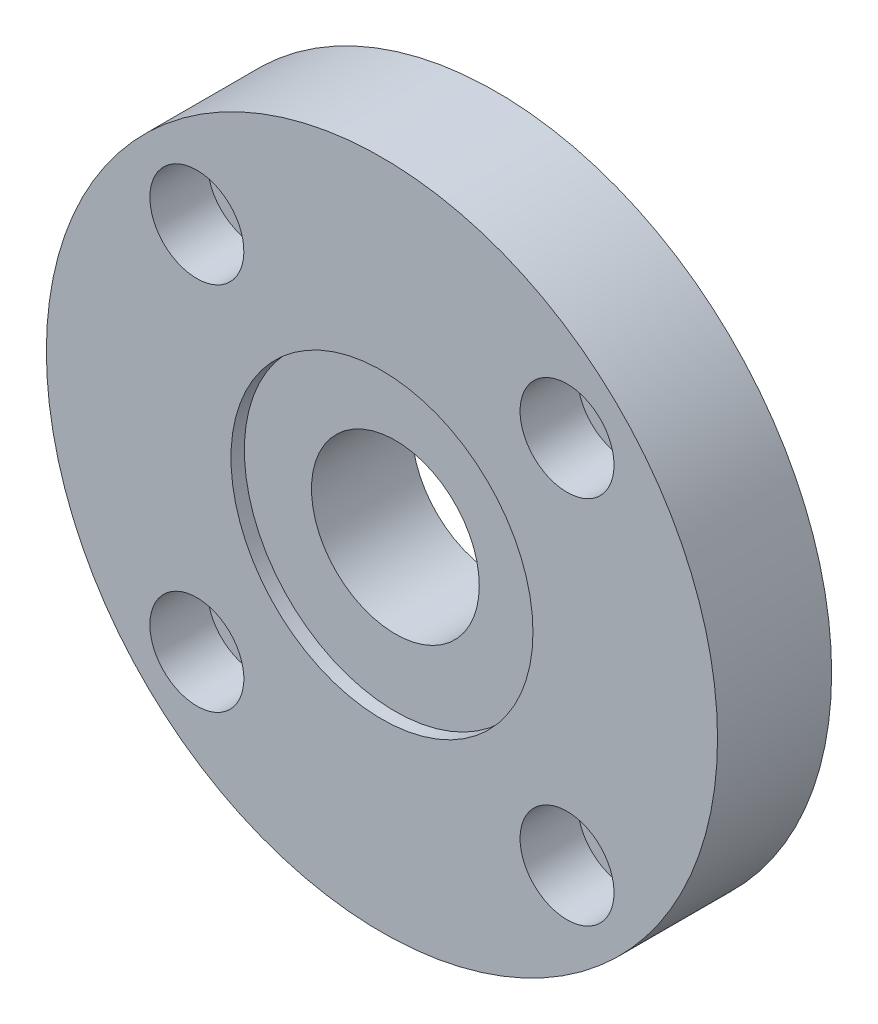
ISO-10303-21;
HEADER;
FILE_DESCRIPTION(('STEP AP214'),'2;1');
FILE_NAME('part.step','',(''),(''),'','','');
FILE_SCHEMA(('AUTOMOTIVE_DESIGN { 1 0 10303 214 1 1 1 1 }'));
ENDSEC;
DATA;
#1=APPLICATION_CONTEXT('core data for automotive mechanical design processes');
#2=APPLICATION_PROTOCOL_DEFINITION('international standard','automotive_design',2000,#1);
#3=PRODUCT_CONTEXT('',#1,'mechanical');
#4=PRODUCT('Part','Part','',(#3));
#5=PRODUCT_RELATED_PRODUCT_CATEGORY('part','',(#4));
#6=PRODUCT_DEFINITION_FORMATION('','',#4);
#7=PRODUCT_DEFINITION_CONTEXT('part definition',#1,'design');
#8=PRODUCT_DEFINITION('design','',#6,#7);
#9=PRODUCT_DEFINITION_SHAPE('','',#8);
#10=(LENGTH_UNIT() NAMED_UNIT(*) SI_UNIT(.MILLI.,.METRE.));
#11=(NAMED_UNIT(*) PLANE_ANGLE_UNIT() SI_UNIT($,.RADIAN.));
#12=(NAMED_UNIT(*) SI_UNIT($,.STERADIAN.) SOLID_ANGLE_UNIT());
#13=UNCERTAINTY_MEASURE_WITH_UNIT(LENGTH_MEASURE(1.E-05),#10,'distance_accuracy_value','');
#14=(GEOMETRIC_REPRESENTATION_CONTEXT(3) GLOBAL_UNCERTAINTY_ASSIGNED_CONTEXT((#13)) GLOBAL_UNIT_ASSIGNED_CONTEXT((#10,
#11,#12)) REPRESENTATION_CONTEXT('',''));
#15=CARTESIAN_POINT('',(0.,0.,0.));
#16=DIRECTION('',(0.,0.,1.));
#17=DIRECTION('',(1.,0.,0.));
#18=AXIS2_PLACEMENT_3D('',#15,#16,#17);
#19=CARTESIAN_POINT('',(0.,0.,17.));
#20=DIRECTION('',(0.,0.,-1.));
#21=DIRECTION('',(-1.,0.,0.));
#22=AXIS2_PLACEMENT_3D('',#19,#20,#21);
#23=CYLINDRICAL_SURFACE('',#22,12.5);
#24=CARTESIAN_POINT('',(0.,0.,0.));
#25=DIRECTION('',(0.,0.,1.));
#26=DIRECTION('',(1.,0.,0.));
#27=AXIS2_PLACEMENT_3D('',#24,#25,#26);
#28=CIRCLE('',#27,12.5);
#29=CARTESIAN_POINT('',(12.5,0.,0.));
#30=VERTEX_POINT('',#29);
#31=EDGE_CURVE('E25',#30,#30,#28,.T.);
#32=ORIENTED_EDGE('',*,*,#31,.F.);
#33=EDGE_LOOP('',(#32));
#34=FACE_BOUND('',#33,.T.);
#35=CARTESIAN_POINT('',(0.,0.,15.));
#36=DIRECTION('',(0.,0.,1.));
#37=DIRECTION('',(1.,0.,0.));
#38=AXIS2_PLACEMENT_3D('',#35,#36,#37);
#39=CIRCLE('',#38,12.5);
#40=CARTESIAN_POINT('',(12.5,0.,15.));
#41=VERTEX_POINT('',#40);
#42=EDGE_CURVE('E16',#41,#41,#39,.T.);
#43=ORIENTED_EDGE('',*,*,#42,.T.);
#44=EDGE_LOOP('',(#43));
#45=FACE_BOUND('',#44,.T.);
#46=ADVANCED_FACE('F12',(#34,#45),#23,.F.);
#47=CARTESIAN_POINT('',(-27.577164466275,27.5771644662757,0.));
#48=DIRECTION('',(0.,0.,1.));
#49=DIRECTION('',(1.,0.,0.));
#50=AXIS2_PLACEMENT_3D('',#47,#48,#49);
#51=CYLINDRICAL_SURFACE('',#50,5.);
#52=CARTESIAN_POINT('',(-27.577164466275,27.5771644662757,0.));
#53=DIRECTION('',(0.,0.,1.));
#54=DIRECTION('',(0.,1.,0.));
#55=AXIS2_PLACEMENT_3D('',#52,#53,#54);
#56=CIRCLE('',#55,5.);
#57=CARTESIAN_POINT('',(-27.5771644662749,32.5771644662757,0.));
#58=VERTEX_POINT('',#57);
#59=EDGE_CURVE('E37',#58,#58,#56,.T.);
#60=ORIENTED_EDGE('',*,*,#59,.F.);
#61=EDGE_LOOP('',(#60));
#62=FACE_BOUND('',#61,.T.);
#63=CARTESIAN_POINT('',(-27.577164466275,27.5771644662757,8.4));
#64=DIRECTION('',(0.,0.,1.));
#65=DIRECTION('',(1.,0.,0.));
#66=AXIS2_PLACEMENT_3D('',#63,#64,#65);
#67=CIRCLE('',#66,5.);
#68=CARTESIAN_POINT('',(-22.577164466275,27.5771644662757,8.4));
#69=VERTEX_POINT('',#68);
#70=EDGE_CURVE('E43',#69,#69,#67,.F.);
#71=ORIENTED_EDGE('',*,*,#70,.F.);
#72=EDGE_LOOP('',(#71));
#73=FACE_BOUND('',#72,.T.);
#74=ADVANCED_FACE('F87',(#62,#73),#51,.F.);
#75=CARTESIAN_POINT('',(-27.5771644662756,-27.5771644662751,0.));
#76=DIRECTION('',(0.,0.,1.));
#77=DIRECTION('',(1.,0.,0.));
#78=AXIS2_PLACEMENT_3D('',#75,#76,#77);
#79=CYLINDRICAL_SURFACE('',#78,5.);
#80=CARTESIAN_POINT('',(-27.5771644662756,-27.5771644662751,0.));
#81=DIRECTION('',(0.,0.,1.));
#82=DIRECTION('',(-1.,0.,0.));
#83=AXIS2_PLACEMENT_3D('',#80,#81,#82);
#84=CIRCLE('',#83,5.);
#85=CARTESIAN_POINT('',(-32.5771644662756,-27.5771644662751,0.));
#86=VERTEX_POINT('',#85);
#87=EDGE_CURVE('E68',#86,#86,#84,.T.);
#88=ORIENTED_EDGE('',*,*,#87,.F.);
#89=EDGE_LOOP('',(#88));
#90=FACE_BOUND('',#89,.T.);
#91=CARTESIAN_POINT('',(-27.5771644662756,-27.5771644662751,8.4));
#92=DIRECTION('',(0.,0.,1.));
#93=DIRECTION('',(1.,0.,0.));
#94=AXIS2_PLACEMENT_3D('',#91,#92,#93);
#95=CIRCLE('',#94,5.);
#96=CARTESIAN_POINT('',(-22.5771644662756,-27.5771644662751,8.4));
#97=VERTEX_POINT('',#96);
#98=EDGE_CURVE('E39',#97,#97,#95,.F.);
#99=ORIENTED_EDGE('',*,*,#98,.F.);
#100=EDGE_LOOP('',(#99));
#101=FACE_BOUND('',#100,.T.);
#102=ADVANCED_FACE('F160',(#90,#101),#79,.F.);
#103=CARTESIAN_POINT('',(27.5771644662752,-27.5771644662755,0.));
#104=DIRECTION('',(0.,0.,1.));
#105=DIRECTION('',(1.,0.,0.));
#106=AXIS2_PLACEMENT_3D('',#103,#104,#105);
#107=CYLINDRICAL_SURFACE('',#106,5.);
#108=CARTESIAN_POINT('',(27.5771644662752,-27.5771644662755,0.));
#109=DIRECTION('',(0.,0.,1.));
#110=DIRECTION('',(0.,-1.,0.));
#111=AXIS2_PLACEMENT_3D('',#108,#109,#110);
#112=CIRCLE('',#111,5.);
#113=CARTESIAN_POINT('',(27.5771644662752,-32.5771644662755,0.));
#114=VERTEX_POINT('',#113);
#115=EDGE_CURVE('E71',#114,#114,#112,.T.);
#116=ORIENTED_EDGE('',*,*,#115,.F.);
#117=EDGE_LOOP('',(#116));
#118=FACE_BOUND('',#117,.T.);
#119=CARTESIAN_POINT('',(27.5771644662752,-27.5771644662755,8.4));
#120=DIRECTION('',(0.,0.,1.));
#121=DIRECTION('',(1.,0.,0.));
#122=AXIS2_PLACEMENT_3D('',#119,#120,#121);
#123=CIRCLE('',#122,5.);
#124=CARTESIAN_POINT('',(32.5771644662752,-27.5771644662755,8.4));
#125=VERTEX_POINT('',#124);
#126=EDGE_CURVE('E34',#125,#125,#123,.F.);
#127=ORIENTED_EDGE('',*,*,#126,.F.);
#128=EDGE_LOOP('',(#127));
#129=FACE_BOUND('',#128,.T.);
#130=ADVANCED_FACE('F135',(#118,#129),#107,.F.);
#131=CARTESIAN_POINT('',(27.5771644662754,27.5771644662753,0.));
#132=DIRECTION('',(0.,0.,1.));
#133=DIRECTION('',(1.,0.,0.));
#134=AXIS2_PLACEMENT_3D('',#131,#132,#133);
#135=CYLINDRICAL_SURFACE('',#134,5.);
#136=CARTESIAN_POINT('',(27.5771644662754,27.5771644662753,0.));
#137=DIRECTION('',(0.,0.,1.));
#138=DIRECTION('',(1.,0.,0.));
#139=AXIS2_PLACEMENT_3D('',#136,#137,#138);
#140=CIRCLE('',#139,5.);
#141=CARTESIAN_POINT('',(32.5771644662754,27.5771644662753,0.));
#142=VERTEX_POINT('',#141);
#143=EDGE_CURVE('E32',#142,#142,#140,.T.);
#144=ORIENTED_EDGE('',*,*,#143,.F.);
#145=EDGE_LOOP('',(#144));
#146=FACE_BOUND('',#145,.T.);
#147=CARTESIAN_POINT('',(27.5771644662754,27.5771644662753,8.4));
#148=DIRECTION('',(0.,0.,1.));
#149=DIRECTION('',(1.,0.,0.));
#150=AXIS2_PLACEMENT_3D('',#147,#148,#149);
#151=CIRCLE('',#150,5.);
#152=CARTESIAN_POINT('',(32.5771644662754,27.5771644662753,8.4));
#153=VERTEX_POINT('',#152);
#154=EDGE_CURVE('E29',#153,#153,#151,.F.);
#155=ORIENTED_EDGE('',*,*,#154,.F.);
#156=EDGE_LOOP('',(#155));
#157=FACE_BOUND('',#156,.T.);
#158=ADVANCED_FACE('F106',(#146,#157),#135,.F.);
#159=CARTESIAN_POINT('',(0.,0.,17.));
#160=DIRECTION('',(0.,0.,1.));
#161=DIRECTION('',(1.,0.,0.));
#162=AXIS2_PLACEMENT_3D('',#159,#160,#161);
#163=PLANE('',#162);
#164=CARTESIAN_POINT('',(0.,0.,17.));
#165=DIRECTION('',(0.,0.,1.));
#166=DIRECTION('',(1.,0.,0.));
#167=AXIS2_PLACEMENT_3D('',#164,#165,#166);
#168=CIRCLE('',#167,22.5);
#169=CARTESIAN_POINT('',(22.5,0.,17.));
#170=VERTEX_POINT('',#169);
#171=EDGE_CURVE('E94',#170,#170,#168,.T.);
#172=ORIENTED_EDGE('',*,*,#171,.F.);
#173=EDGE_LOOP('',(#172));
#174=FACE_BOUND('',#173,.T.);
#175=CARTESIAN_POINT('',(-27.577164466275,27.5771644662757,17.));
#176=DIRECTION('',(0.,0.,1.));
#177=DIRECTION('',(0.,1.,0.));
#178=AXIS2_PLACEMENT_3D('',#175,#176,#177);
#179=CIRCLE('',#178,7.);
#180=CARTESIAN_POINT('',(-27.5771644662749,34.5771644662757,17.));
#181=VERTEX_POINT('',#180);
#182=EDGE_CURVE('E52',#181,#181,#179,.T.);
#183=ORIENTED_EDGE('',*,*,#182,.F.);
#184=EDGE_LOOP('',(#183));
#185=FACE_BOUND('',#184,.T.);
#186=CARTESIAN_POINT('',(-27.5771644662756,-27.5771644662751,17.));
#187=DIRECTION('',(0.,0.,1.));
#188=DIRECTION('',(-1.,0.,0.));
#189=AXIS2_PLACEMENT_3D('',#186,#187,#188);
#190=CIRCLE('',#189,7.);
#191=CARTESIAN_POINT('',(-34.5771644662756,-27.5771644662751,17.));
#192=VERTEX_POINT('',#191);
#193=EDGE_CURVE('E45',#192,#192,#190,.T.);
#194=ORIENTED_EDGE('',*,*,#193,.F.);
#195=EDGE_LOOP('',(#194));
#196=FACE_BOUND('',#195,.T.);
#197=CARTESIAN_POINT('',(27.5771644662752,-27.5771644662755,17.));
#198=DIRECTION('',(0.,0.,1.));
#199=DIRECTION('',(0.,-1.,0.));
#200=AXIS2_PLACEMENT_3D('',#197,#198,#199);
#201=CIRCLE('',#200,7.);
#202=CARTESIAN_POINT('',(27.5771644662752,-34.5771644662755,17.));
#203=VERTEX_POINT('',#202);
#204=EDGE_CURVE('E41',#203,#203,#201,.T.);
#205=ORIENTED_EDGE('',*,*,#204,.F.);
#206=EDGE_LOOP('',(#205));
#207=FACE_BOUND('',#206,.T.);
#208=CARTESIAN_POINT('',(27.5771644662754,27.5771644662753,17.));
#209=DIRECTION('',(0.,0.,1.));
#210=DIRECTION('',(1.,0.,0.));
#211=AXIS2_PLACEMENT_3D('',#208,#209,#210);
#212=CIRCLE('',#211,7.);
#213=CARTESIAN_POINT('',(34.5771644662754,27.5771644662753,17.));
#214=VERTEX_POINT('',#213);
#215=EDGE_CURVE('E74',#214,#214,#212,.T.);
#216=ORIENTED_EDGE('',*,*,#215,.F.);
#217=EDGE_LOOP('',(#216));
#218=FACE_BOUND('',#217,.T.);
#219=CARTESIAN_POINT('',(0.,0.,17.));
#220=DIRECTION('',(0.,0.,1.));
#221=DIRECTION('',(1.,0.,0.));
#222=AXIS2_PLACEMENT_3D('',#219,#220,#221);
#223=CIRCLE('',#222,50.);
#224=CARTESIAN_POINT('',(50.,0.,17.));
#225=VERTEX_POINT('',#224);
#226=EDGE_CURVE('E8',#225,#225,#223,.T.);
#227=ORIENTED_EDGE('',*,*,#226,.T.);
#228=EDGE_LOOP('',(#227));
#229=FACE_BOUND('',#228,.T.);
#230=ADVANCED_FACE('F103',(#174,#185,#196,#207,#218,#229),#163,.T.);
#231=CARTESIAN_POINT('',(0.,0.,0.));
#232=DIRECTION('',(0.,0.,1.));
#233=DIRECTION('',(1.,0.,0.));
#234=AXIS2_PLACEMENT_3D('',#231,#232,#233);
#235=PLANE('',#234);
#236=ORIENTED_EDGE('',*,*,#59,.T.);
#237=EDGE_LOOP('',(#236));
#238=FACE_BOUND('',#237,.T.);
#239=ORIENTED_EDGE('',*,*,#87,.T.);
#240=EDGE_LOOP('',(#239));
#241=FACE_BOUND('',#240,.T.);
#242=ORIENTED_EDGE('',*,*,#115,.T.);
#243=EDGE_LOOP('',(#242));
#244=FACE_BOUND('',#243,.T.);
#245=ORIENTED_EDGE('',*,*,#143,.T.);
#246=EDGE_LOOP('',(#245));
#247=FACE_BOUND('',#246,.T.);
#248=CARTESIAN_POINT('',(0.,0.,0.));
#249=DIRECTION('',(0.,0.,1.));
#250=DIRECTION('',(1.,0.,0.));
#251=AXIS2_PLACEMENT_3D('',#248,#249,#250);
#252=CIRCLE('',#251,50.);
#253=CARTESIAN_POINT('',(50.,0.,0.));
#254=VERTEX_POINT('',#253);
#255=EDGE_CURVE('E20',#254,#254,#252,.T.);
#256=ORIENTED_EDGE('',*,*,#255,.F.);
#257=EDGE_LOOP('',(#256));
#258=FACE_BOUND('',#257,.T.);
#259=ORIENTED_EDGE('',*,*,#31,.T.);
#260=EDGE_LOOP('',(#259));
#261=FACE_BOUND('',#260,.T.);
#262=ADVANCED_FACE('F83',(#238,#241,#244,#247,#258,#261),#235,.F.);
#263=CARTESIAN_POINT('',(0.,0.,17.));
#264=DIRECTION('',(0.,0.,-1.));
#265=DIRECTION('',(-1.,0.,0.));
#266=AXIS2_PLACEMENT_3D('',#263,#264,#265);
#267=CYLINDRICAL_SURFACE('',#266,50.);
#268=ORIENTED_EDGE('',*,*,#226,.F.);
#269=EDGE_LOOP('',(#268));
#270=FACE_BOUND('',#269,.T.);
#271=ORIENTED_EDGE('',*,*,#255,.T.);
#272=EDGE_LOOP('',(#271));
#273=FACE_BOUND('',#272,.T.);
#274=ADVANCED_FACE('F14',(#270,#273),#267,.T.);
#275=CARTESIAN_POINT('',(27.5771644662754,27.5771644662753,8.4));
#276=DIRECTION('',(0.,0.,1.));
#277=DIRECTION('',(1.,0.,0.));
#278=AXIS2_PLACEMENT_3D('',#275,#276,#277);
#279=PLANE('',#278);
#280=CARTESIAN_POINT('',(27.5771644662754,27.5771644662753,8.4));
#281=DIRECTION('',(0.,0.,1.));
#282=DIRECTION('',(1.,0.,0.));
#283=AXIS2_PLACEMENT_3D('',#280,#281,#282);
#284=CIRCLE('',#283,7.);
#285=CARTESIAN_POINT('',(34.5771644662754,27.5771644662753,8.4));
#286=VERTEX_POINT('',#285);
#287=EDGE_CURVE('E33',#286,#286,#284,.T.);
#288=ORIENTED_EDGE('',*,*,#287,.T.);
#289=EDGE_LOOP('',(#288));
#290=FACE_BOUND('',#289,.T.);
#291=ORIENTED_EDGE('',*,*,#154,.T.);
#292=EDGE_LOOP('',(#291));
#293=FACE_BOUND('',#292,.T.);
#294=ADVANCED_FACE('F118',(#290,#293),#279,.T.);
#295=CARTESIAN_POINT('',(27.5771644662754,27.5771644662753,8.4));
#296=DIRECTION('',(0.,0.,1.));
#297=DIRECTION('',(1.,0.,0.));
#298=AXIS2_PLACEMENT_3D('',#295,#296,#297);
#299=CYLINDRICAL_SURFACE('',#298,7.);
#300=ORIENTED_EDGE('',*,*,#287,.F.);
#301=EDGE_LOOP('',(#300));
#302=FACE_BOUND('',#301,.T.);
#303=ORIENTED_EDGE('',*,*,#215,.T.);
#304=EDGE_LOOP('',(#303));
#305=FACE_BOUND('',#304,.T.);
#306=ADVANCED_FACE('F115',(#302,#305),#299,.F.);
#307=CARTESIAN_POINT('',(27.5771644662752,-27.5771644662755,8.4));
#308=DIRECTION('',(0.,0.,1.));
#309=DIRECTION('',(0.,-1.,0.));
#310=AXIS2_PLACEMENT_3D('',#307,#308,#309);
#311=PLANE('',#310);
#312=CARTESIAN_POINT('',(27.5771644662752,-27.5771644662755,8.4));
#313=DIRECTION('',(0.,0.,1.));
#314=DIRECTION('',(0.,-1.,0.));
#315=AXIS2_PLACEMENT_3D('',#312,#313,#314);
#316=CIRCLE('',#315,7.);
#317=CARTESIAN_POINT('',(27.5771644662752,-34.5771644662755,8.4));
#318=VERTEX_POINT('',#317);
#319=EDGE_CURVE('E38',#318,#318,#316,.T.);
#320=ORIENTED_EDGE('',*,*,#319,.T.);
#321=EDGE_LOOP('',(#320));
#322=FACE_BOUND('',#321,.T.);
#323=ORIENTED_EDGE('',*,*,#126,.T.);
#324=EDGE_LOOP('',(#323));
#325=FACE_BOUND('',#324,.T.);
#326=ADVANCED_FACE('F117',(#322,#325),#311,.T.);
#327=CARTESIAN_POINT('',(27.5771644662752,-27.5771644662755,8.4));
#328=DIRECTION('',(0.,0.,1.));
#329=DIRECTION('',(1.,0.,0.));
#330=AXIS2_PLACEMENT_3D('',#327,#328,#329);
#331=CYLINDRICAL_SURFACE('',#330,7.);
#332=ORIENTED_EDGE('',*,*,#319,.F.);
#333=EDGE_LOOP('',(#332));
#334=FACE_BOUND('',#333,.T.);
#335=ORIENTED_EDGE('',*,*,#204,.T.);
#336=EDGE_LOOP('',(#335));
#337=FACE_BOUND('',#336,.T.);
#338=ADVANCED_FACE('F126',(#334,#337),#331,.F.);
#339=CARTESIAN_POINT('',(-27.5771644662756,-27.5771644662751,8.4));
#340=DIRECTION('',(0.,0.,1.));
#341=DIRECTION('',(-1.,0.,0.));
#342=AXIS2_PLACEMENT_3D('',#339,#340,#341);
#343=PLANE('',#342);
#344=CARTESIAN_POINT('',(-27.5771644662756,-27.5771644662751,8.4));
#345=DIRECTION('',(0.,0.,1.));
#346=DIRECTION('',(-1.,0.,0.));
#347=AXIS2_PLACEMENT_3D('',#344,#345,#346);
#348=CIRCLE('',#347,7.);
#349=CARTESIAN_POINT('',(-34.5771644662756,-27.5771644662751,8.4));
#350=VERTEX_POINT('',#349);
#351=EDGE_CURVE('E42',#350,#350,#348,.T.);
#352=ORIENTED_EDGE('',*,*,#351,.T.);
#353=EDGE_LOOP('',(#352));
#354=FACE_BOUND('',#353,.T.);
#355=ORIENTED_EDGE('',*,*,#98,.T.);
#356=EDGE_LOOP('',(#355));
#357=FACE_BOUND('',#356,.T.);
#358=ADVANCED_FACE('F173',(#354,#357),#343,.T.);
#359=CARTESIAN_POINT('',(-27.5771644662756,-27.5771644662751,8.4));
#360=DIRECTION('',(0.,0.,1.));
#361=DIRECTION('',(1.,0.,0.));
#362=AXIS2_PLACEMENT_3D('',#359,#360,#361);
#363=CYLINDRICAL_SURFACE('',#362,7.);
#364=ORIENTED_EDGE('',*,*,#351,.F.);
#365=EDGE_LOOP('',(#364));
#366=FACE_BOUND('',#365,.T.);
#367=ORIENTED_EDGE('',*,*,#193,.T.);
#368=EDGE_LOOP('',(#367));
#369=FACE_BOUND('',#368,.T.);
#370=ADVANCED_FACE('F176',(#366,#369),#363,.F.);
#371=CARTESIAN_POINT('',(-27.577164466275,27.5771644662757,8.4));
#372=DIRECTION('',(0.,0.,1.));
#373=DIRECTION('',(0.,1.,0.));
#374=AXIS2_PLACEMENT_3D('',#371,#372,#373);
#375=PLANE('',#374);
#376=CARTESIAN_POINT('',(-27.577164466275,27.5771644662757,8.4));
#377=DIRECTION('',(0.,0.,1.));
#378=DIRECTION('',(0.,1.,0.));
#379=AXIS2_PLACEMENT_3D('',#376,#377,#378);
#380=CIRCLE('',#379,7.);
#381=CARTESIAN_POINT('',(-27.5771644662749,34.5771644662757,8.4));
#382=VERTEX_POINT('',#381);
#383=EDGE_CURVE('E46',#382,#382,#380,.T.);
#384=ORIENTED_EDGE('',*,*,#383,.T.);
#385=EDGE_LOOP('',(#384));
#386=FACE_BOUND('',#385,.T.);
#387=ORIENTED_EDGE('',*,*,#70,.T.);
#388=EDGE_LOOP('',(#387));
#389=FACE_BOUND('',#388,.T.);
#390=ADVANCED_FACE('F179',(#386,#389),#375,.T.);
#391=CARTESIAN_POINT('',(-27.577164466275,27.5771644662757,8.4));
#392=DIRECTION('',(0.,0.,1.));
#393=DIRECTION('',(1.,0.,0.));
#394=AXIS2_PLACEMENT_3D('',#391,#392,#393);
#395=CYLINDRICAL_SURFACE('',#394,7.);
#396=ORIENTED_EDGE('',*,*,#383,.F.);
#397=EDGE_LOOP('',(#396));
#398=FACE_BOUND('',#397,.T.);
#399=ORIENTED_EDGE('',*,*,#182,.T.);
#400=EDGE_LOOP('',(#399));
#401=FACE_BOUND('',#400,.T.);
#402=ADVANCED_FACE('F184',(#398,#401),#395,.F.);
#403=CARTESIAN_POINT('',(0.,0.,15.));
#404=DIRECTION('',(0.,0.,1.));
#405=DIRECTION('',(1.,0.,0.));
#406=AXIS2_PLACEMENT_3D('',#403,#404,#405);
#407=CYLINDRICAL_SURFACE('',#406,22.5);
#408=CARTESIAN_POINT('',(0.,0.,15.));
#409=DIRECTION('',(0.,0.,1.));
#410=DIRECTION('',(1.,0.,0.));
#411=AXIS2_PLACEMENT_3D('',#408,#409,#410);
#412=CIRCLE('',#411,22.5);
#413=CARTESIAN_POINT('',(22.5,0.,15.));
#414=VERTEX_POINT('',#413);
#415=EDGE_CURVE('E92',#414,#414,#412,.T.);
#416=ORIENTED_EDGE('',*,*,#415,.F.);
#417=EDGE_LOOP('',(#416));
#418=FACE_BOUND('',#417,.T.);
#419=ORIENTED_EDGE('',*,*,#171,.T.);
#420=EDGE_LOOP('',(#419));
#421=FACE_BOUND('',#420,.T.);
#422=ADVANCED_FACE('F101',(#418,#421),#407,.F.);
#423=CARTESIAN_POINT('',(0.,0.,15.));
#424=DIRECTION('',(0.,0.,1.));
#425=DIRECTION('',(1.,0.,0.));
#426=AXIS2_PLACEMENT_3D('',#423,#424,#425);
#427=PLANE('',#426);
#428=ORIENTED_EDGE('',*,*,#42,.F.);
#429=EDGE_LOOP('',(#428));
#430=FACE_BOUND('',#429,.T.);
#431=ORIENTED_EDGE('',*,*,#415,.T.);
#432=EDGE_LOOP('',(#431));
#433=FACE_BOUND('',#432,.T.);
#434=ADVANCED_FACE('F188',(#430,#433),#427,.T.);
#435=CLOSED_SHELL('',(#46,#74,#102,#130,#158,#230,#262,#274,#294,#306,#326,#338,#358,#370,#390,
#402,#422,#434));
#436=MANIFOLD_SOLID_BREP('B1',#435);
#437=ADVANCED_BREP_SHAPE_REPRESENTATION('',(#18,#436),#14);
#438=SHAPE_DEFINITION_REPRESENTATION(#9,#437);
ENDSEC;
END-ISO-10303-21;
